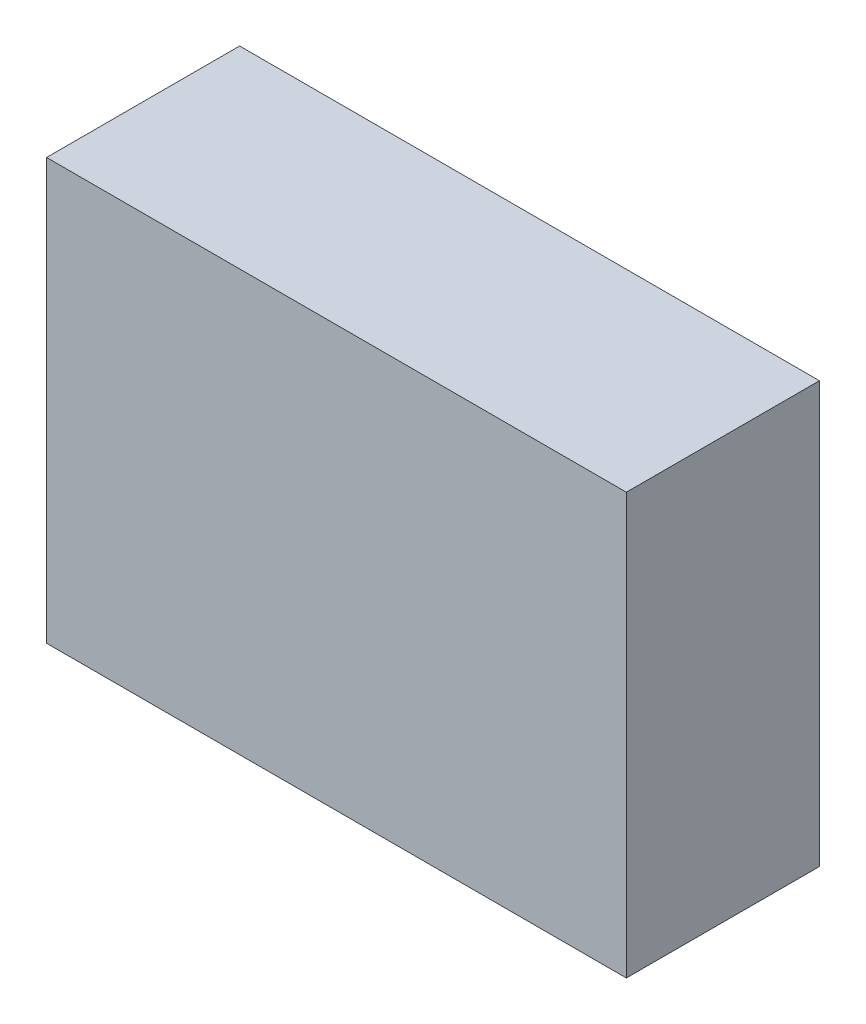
from build123d import *

# Parameters (mm, degrees)
SKETCH1_W      = 49.580976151
SKETCH1_H      = 35.977990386
EXTRUDE1_DEPTH = 16.51


with BuildPart() as part:
    # Sketch1 → Extrude1 (new body)
    with BuildSketch(Plane.XY):
        with Locations((24.790488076, 17.988995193)):
            Rectangle(SKETCH1_W, SKETCH1_H)
    extrude(amount=EXTRUDE1_DEPTH)


solid = part.part
